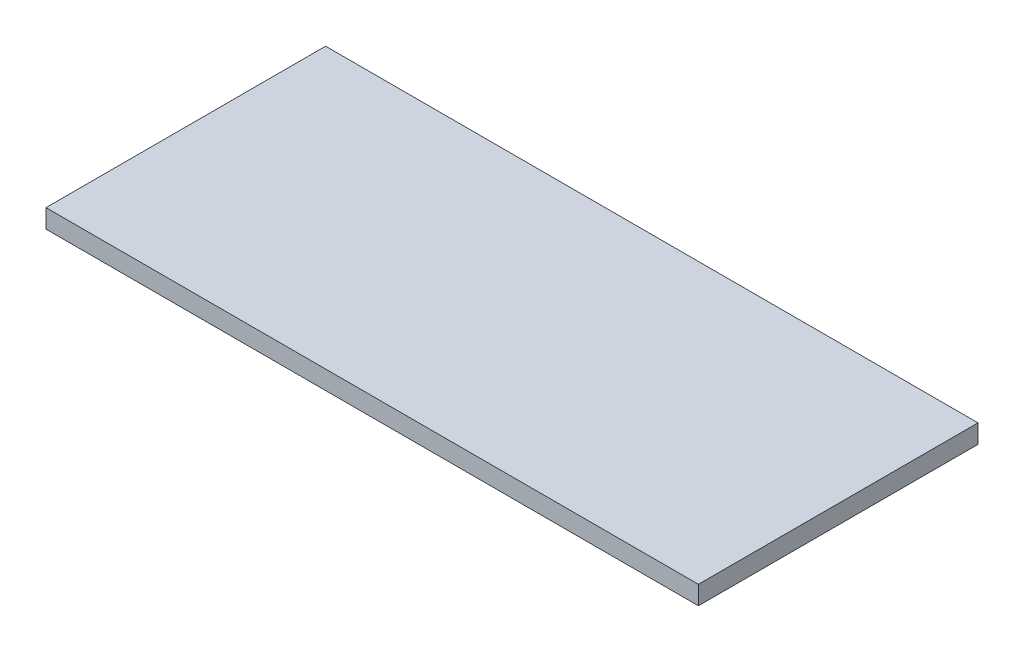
ISO-10303-21;
HEADER;
FILE_DESCRIPTION(('STEP AP214'),'2;1');
FILE_NAME('part.step','',(''),(''),'','','');
FILE_SCHEMA(('AUTOMOTIVE_DESIGN { 1 0 10303 214 1 1 1 1 }'));
ENDSEC;
DATA;
#1=APPLICATION_CONTEXT('core data for automotive mechanical design processes');
#2=APPLICATION_PROTOCOL_DEFINITION('international standard','automotive_design',2000,#1);
#3=PRODUCT_CONTEXT('',#1,'mechanical');
#4=PRODUCT('Part','Part','',(#3));
#5=PRODUCT_RELATED_PRODUCT_CATEGORY('part','',(#4));
#6=PRODUCT_DEFINITION_FORMATION('','',#4);
#7=PRODUCT_DEFINITION_CONTEXT('part definition',#1,'design');
#8=PRODUCT_DEFINITION('design','',#6,#7);
#9=PRODUCT_DEFINITION_SHAPE('','',#8);
#10=(LENGTH_UNIT() NAMED_UNIT(*) SI_UNIT(.MILLI.,.METRE.));
#11=(NAMED_UNIT(*) PLANE_ANGLE_UNIT() SI_UNIT($,.RADIAN.));
#12=(NAMED_UNIT(*) SI_UNIT($,.STERADIAN.) SOLID_ANGLE_UNIT());
#13=UNCERTAINTY_MEASURE_WITH_UNIT(LENGTH_MEASURE(1.E-05),#10,'distance_accuracy_value','');
#14=(GEOMETRIC_REPRESENTATION_CONTEXT(3) GLOBAL_UNCERTAINTY_ASSIGNED_CONTEXT((#13)) GLOBAL_UNIT_ASSIGNED_CONTEXT((#10,
#11,#12)) REPRESENTATION_CONTEXT('',''));
#15=CARTESIAN_POINT('',(0.,0.,0.));
#16=DIRECTION('',(0.,0.,1.));
#17=DIRECTION('',(1.,0.,0.));
#18=AXIS2_PLACEMENT_3D('',#15,#16,#17);
#19=CARTESIAN_POINT('',(-200.,0.,150.));
#20=DIRECTION('',(1.,0.,0.));
#21=DIRECTION('',(0.,0.,-1.));
#22=AXIS2_PLACEMENT_3D('',#19,#20,#21);
#23=PLANE('',#22);
#24=DIRECTION('',(0.,-1.,0.));
#25=VECTOR('',#24,1.);
#26=CARTESIAN_POINT('',(-200.,0.,-150.));
#27=LINE('',#26,#25);
#28=CARTESIAN_POINT('',(-200.,0.,-150.));
#29=VERTEX_POINT('',#28);
#30=CARTESIAN_POINT('',(-200.,-20.,-150.));
#31=VERTEX_POINT('',#30);
#32=EDGE_CURVE('E94',#29,#31,#27,.T.);
#33=ORIENTED_EDGE('',*,*,#32,.T.);
#34=DIRECTION('',(0.,0.,-1.));
#35=VECTOR('',#34,1.);
#36=CARTESIAN_POINT('',(-200.,-20.,150.));
#37=LINE('',#36,#35);
#38=CARTESIAN_POINT('',(-200.,-20.,150.));
#39=VERTEX_POINT('',#38);
#40=EDGE_CURVE('E11',#39,#31,#37,.T.);
#41=ORIENTED_EDGE('',*,*,#40,.F.);
#42=DIRECTION('',(0.,-1.,0.));
#43=VECTOR('',#42,1.);
#44=CARTESIAN_POINT('',(-200.,0.,150.));
#45=LINE('',#44,#43);
#46=CARTESIAN_POINT('',(-200.,0.,150.));
#47=VERTEX_POINT('',#46);
#48=EDGE_CURVE('E82',#47,#39,#45,.T.);
#49=ORIENTED_EDGE('',*,*,#48,.F.);
#50=DIRECTION('',(0.,0.,-1.));
#51=VECTOR('',#50,1.);
#52=CARTESIAN_POINT('',(-200.,0.,150.));
#53=LINE('',#52,#51);
#54=EDGE_CURVE('E90',#47,#29,#53,.T.);
#55=ORIENTED_EDGE('',*,*,#54,.T.);
#56=EDGE_LOOP('',(#33,#41,#49,#55));
#57=FACE_BOUND('',#56,.T.);
#58=ADVANCED_FACE('F31',(#57),#23,.F.);
#59=CARTESIAN_POINT('',(-200.,-20.,150.));
#60=DIRECTION('',(0.,1.,0.));
#61=DIRECTION('',(0.,0.,1.));
#62=AXIS2_PLACEMENT_3D('',#59,#60,#61);
#63=PLANE('',#62);
#64=DIRECTION('',(1.,0.,0.));
#65=VECTOR('',#64,1.);
#66=CARTESIAN_POINT('',(-200.,-20.,-150.));
#67=LINE('',#66,#65);
#68=CARTESIAN_POINT('',(500.,-20.,-150.));
#69=VERTEX_POINT('',#68);
#70=EDGE_CURVE('E86',#31,#69,#67,.T.);
#71=ORIENTED_EDGE('',*,*,#70,.T.);
#72=DIRECTION('',(0.,0.,-1.));
#73=VECTOR('',#72,1.);
#74=CARTESIAN_POINT('',(500.,-20.,150.));
#75=LINE('',#74,#73);
#76=CARTESIAN_POINT('',(500.,-20.,150.));
#77=VERTEX_POINT('',#76);
#78=EDGE_CURVE('E39',#77,#69,#75,.T.);
#79=ORIENTED_EDGE('',*,*,#78,.F.);
#80=DIRECTION('',(1.,0.,0.));
#81=VECTOR('',#80,1.);
#82=CARTESIAN_POINT('',(-200.,-20.,150.));
#83=LINE('',#82,#81);
#84=EDGE_CURVE('E77',#39,#77,#83,.T.);
#85=ORIENTED_EDGE('',*,*,#84,.F.);
#86=ORIENTED_EDGE('',*,*,#40,.T.);
#87=EDGE_LOOP('',(#71,#79,#85,#86));
#88=FACE_BOUND('',#87,.T.);
#89=ADVANCED_FACE('F85',(#88),#63,.F.);
#90=CARTESIAN_POINT('',(500.,0.,150.));
#91=DIRECTION('',(-1.,0.,0.));
#92=DIRECTION('',(0.,0.,1.));
#93=AXIS2_PLACEMENT_3D('',#90,#91,#92);
#94=PLANE('',#93);
#95=DIRECTION('',(0.,1.,0.));
#96=VECTOR('',#95,1.);
#97=CARTESIAN_POINT('',(500.,0.,-150.));
#98=LINE('',#97,#96);
#99=CARTESIAN_POINT('',(500.,0.,-150.));
#100=VERTEX_POINT('',#99);
#101=EDGE_CURVE('E64',#69,#100,#98,.T.);
#102=ORIENTED_EDGE('',*,*,#101,.T.);
#103=DIRECTION('',(0.,0.,-1.));
#104=VECTOR('',#103,1.);
#105=CARTESIAN_POINT('',(500.,0.,150.));
#106=LINE('',#105,#104);
#107=CARTESIAN_POINT('',(500.,0.,150.));
#108=VERTEX_POINT('',#107);
#109=EDGE_CURVE('E87',#108,#100,#106,.T.);
#110=ORIENTED_EDGE('',*,*,#109,.F.);
#111=DIRECTION('',(0.,1.,0.));
#112=VECTOR('',#111,1.);
#113=CARTESIAN_POINT('',(500.,0.,150.));
#114=LINE('',#113,#112);
#115=EDGE_CURVE('E80',#77,#108,#114,.T.);
#116=ORIENTED_EDGE('',*,*,#115,.F.);
#117=ORIENTED_EDGE('',*,*,#78,.T.);
#118=EDGE_LOOP('',(#102,#110,#116,#117));
#119=FACE_BOUND('',#118,.T.);
#120=ADVANCED_FACE('F88',(#119),#94,.F.);
#121=CARTESIAN_POINT('',(-200.,0.,150.));
#122=DIRECTION('',(0.,-1.,0.));
#123=DIRECTION('',(0.,0.,-1.));
#124=AXIS2_PLACEMENT_3D('',#121,#122,#123);
#125=PLANE('',#124);
#126=DIRECTION('',(-1.,0.,0.));
#127=VECTOR('',#126,1.);
#128=CARTESIAN_POINT('',(-200.,0.,-150.));
#129=LINE('',#128,#127);
#130=EDGE_CURVE('E70',#100,#29,#129,.T.);
#131=ORIENTED_EDGE('',*,*,#130,.T.);
#132=ORIENTED_EDGE('',*,*,#54,.F.);
#133=DIRECTION('',(-1.,0.,0.));
#134=VECTOR('',#133,1.);
#135=CARTESIAN_POINT('',(-200.,0.,150.));
#136=LINE('',#135,#134);
#137=EDGE_CURVE('E47',#108,#47,#136,.T.);
#138=ORIENTED_EDGE('',*,*,#137,.F.);
#139=ORIENTED_EDGE('',*,*,#109,.T.);
#140=EDGE_LOOP('',(#131,#132,#138,#139));
#141=FACE_BOUND('',#140,.T.);
#142=ADVANCED_FACE('F101',(#141),#125,.F.);
#143=CARTESIAN_POINT('',(-200.,-20.,150.));
#144=DIRECTION('',(0.,0.,1.));
#145=DIRECTION('',(1.,0.,0.));
#146=AXIS2_PLACEMENT_3D('',#143,#144,#145);
#147=PLANE('',#146);
#148=ORIENTED_EDGE('',*,*,#48,.T.);
#149=ORIENTED_EDGE('',*,*,#84,.T.);
#150=ORIENTED_EDGE('',*,*,#115,.T.);
#151=ORIENTED_EDGE('',*,*,#137,.T.);
#152=EDGE_LOOP('',(#148,#149,#150,#151));
#153=FACE_BOUND('',#152,.T.);
#154=ADVANCED_FACE('F78',(#153),#147,.T.);
#155=CARTESIAN_POINT('',(-200.,-20.,-150.));
#156=DIRECTION('',(0.,0.,1.));
#157=DIRECTION('',(1.,0.,0.));
#158=AXIS2_PLACEMENT_3D('',#155,#156,#157);
#159=PLANE('',#158);
#160=ORIENTED_EDGE('',*,*,#32,.F.);
#161=ORIENTED_EDGE('',*,*,#130,.F.);
#162=ORIENTED_EDGE('',*,*,#101,.F.);
#163=ORIENTED_EDGE('',*,*,#70,.F.);
#164=EDGE_LOOP('',(#160,#161,#162,#163));
#165=FACE_BOUND('',#164,.T.);
#166=ADVANCED_FACE('F104',(#165),#159,.F.);
#167=CLOSED_SHELL('',(#58,#89,#120,#142,#154,#166));
#168=MANIFOLD_SOLID_BREP('B2',#167);
#169=ADVANCED_BREP_SHAPE_REPRESENTATION('',(#18,#168),#14);
#170=SHAPE_DEFINITION_REPRESENTATION(#9,#169);
ENDSEC;
END-ISO-10303-21;
